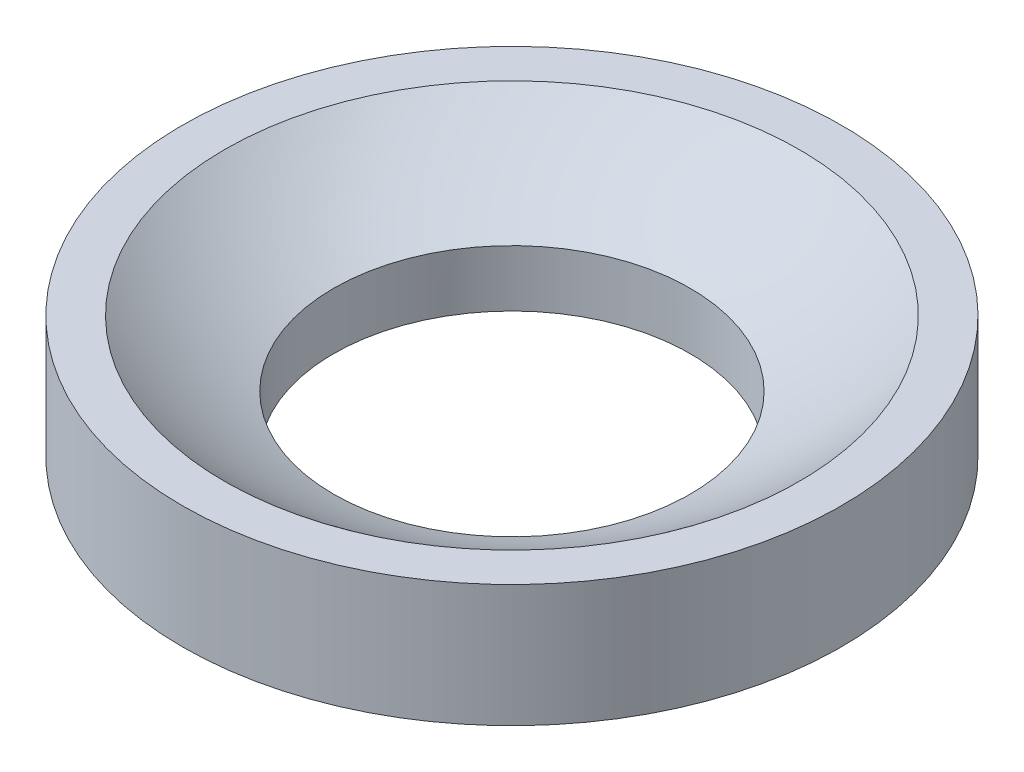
ISO-10303-21;
HEADER;
FILE_DESCRIPTION(('STEP AP214'),'2;1');
FILE_NAME('part.step','',(''),(''),'','','');
FILE_SCHEMA(('AUTOMOTIVE_DESIGN { 1 0 10303 214 1 1 1 1 }'));
ENDSEC;
DATA;
#1=APPLICATION_CONTEXT('core data for automotive mechanical design processes');
#2=APPLICATION_PROTOCOL_DEFINITION('international standard','automotive_design',2000,#1);
#3=PRODUCT_CONTEXT('',#1,'mechanical');
#4=PRODUCT('Part','Part','',(#3));
#5=PRODUCT_RELATED_PRODUCT_CATEGORY('part','',(#4));
#6=PRODUCT_DEFINITION_FORMATION('','',#4);
#7=PRODUCT_DEFINITION_CONTEXT('part definition',#1,'design');
#8=PRODUCT_DEFINITION('design','',#6,#7);
#9=PRODUCT_DEFINITION_SHAPE('','',#8);
#10=(LENGTH_UNIT() NAMED_UNIT(*) SI_UNIT(.MILLI.,.METRE.));
#11=(NAMED_UNIT(*) PLANE_ANGLE_UNIT() SI_UNIT($,.RADIAN.));
#12=(NAMED_UNIT(*) SI_UNIT($,.STERADIAN.) SOLID_ANGLE_UNIT());
#13=UNCERTAINTY_MEASURE_WITH_UNIT(LENGTH_MEASURE(1.E-05),#10,'distance_accuracy_value','');
#14=(GEOMETRIC_REPRESENTATION_CONTEXT(3) GLOBAL_UNCERTAINTY_ASSIGNED_CONTEXT((#13)) GLOBAL_UNIT_ASSIGNED_CONTEXT((#10,
#11,#12)) REPRESENTATION_CONTEXT('',''));
#15=CARTESIAN_POINT('',(0.,0.,0.));
#16=DIRECTION('',(0.,0.,1.));
#17=DIRECTION('',(1.,0.,0.));
#18=AXIS2_PLACEMENT_3D('',#15,#16,#17);
#19=CARTESIAN_POINT('',(474.940237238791,278.214667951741,0.));
#20=DIRECTION('',(0.,1.,0.));
#21=DIRECTION('',(-1.,0.,0.));
#22=AXIS2_PLACEMENT_3D('',#19,#20,#21);
#23=SPHERICAL_SURFACE('',#22,16.2707005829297);
#24=CARTESIAN_POINT('',(474.940237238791,265.57848191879,0.));
#25=DIRECTION('',(0.,1.,0.));
#26=DIRECTION('',(0.,0.,1.));
#27=AXIS2_PLACEMENT_3D('',#24,#25,#26);
#28=CIRCLE('',#27,10.25);
#29=CARTESIAN_POINT('',(464.690237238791,265.57848191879,0.));
#30=VERTEX_POINT('',#29);
#31=EDGE_CURVE('E49',#30,#30,#28,.T.);
#32=CARTESIAN_POINT('',(474.940237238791,263.23848360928,0.));
#33=DIRECTION('',(0.,1.,0.));
#34=DIRECTION('',(0.,0.,1.));
#35=AXIS2_PLACEMENT_3D('',#32,#33,#34);
#36=CIRCLE('',#35,6.35999999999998);
#37=CARTESIAN_POINT('',(468.580237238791,263.23848360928,0.));
#38=VERTEX_POINT('',#37);
#39=EDGE_CURVE('E10',#38,#38,#36,.T.);
#40=CARTESIAN_POINT('',(464.690237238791,265.57848191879,0.));
#41=CARTESIAN_POINT('',(464.727081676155,265.548595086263,0.));
#42=CARTESIAN_POINT('',(464.764056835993,265.518869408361,0.));
#43=CARTESIAN_POINT('',(464.838265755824,265.459742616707,0.));
#44=CARTESIAN_POINT('',(464.875499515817,265.430341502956,0.));
#45=CARTESIAN_POINT('',(464.950222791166,265.371866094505,0.));
#46=CARTESIAN_POINT('',(464.987712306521,265.342791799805,0.));
#47=CARTESIAN_POINT('',(465.06294422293,265.284972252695,0.));
#48=CARTESIAN_POINT('',(465.100686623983,265.256227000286,0.));
#49=CARTESIAN_POINT('',(465.176421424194,265.199067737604,0.));
#50=CARTESIAN_POINT('',(465.214413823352,265.170653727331,0.));
#51=CARTESIAN_POINT('',(465.290645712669,265.114159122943,0.));
#52=CARTESIAN_POINT('',(465.328885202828,265.086078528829,0.));
#53=CARTESIAN_POINT('',(465.405608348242,265.030252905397,0.));
#54=CARTESIAN_POINT('',(465.444092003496,265.00250787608,0.));
#55=CARTESIAN_POINT('',(465.521300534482,264.947355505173,0.));
#56=CARTESIAN_POINT('',(465.560025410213,264.919948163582,0.));
#57=CARTESIAN_POINT('',(465.637713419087,264.865473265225,0.));
#58=CARTESIAN_POINT('',(465.676676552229,264.838405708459,0.));
#59=CARTESIAN_POINT('',(465.754838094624,264.78461245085,0.));
#60=CARTESIAN_POINT('',(465.794036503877,264.757886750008,0.));
#61=CARTESIAN_POINT('',(465.872665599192,264.704779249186,0.));
#62=CARTESIAN_POINT('',(465.912096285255,264.678397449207,0.));
#63=CARTESIAN_POINT('',(465.991186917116,264.625979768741,0.));
#64=CARTESIAN_POINT('',(466.030846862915,264.599943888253,0.));
#65=CARTESIAN_POINT('',(466.110392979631,264.548220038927,0.));
#66=CARTESIAN_POINT('',(466.150279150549,264.522532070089,0.));
#67=CARTESIAN_POINT('',(466.230274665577,264.471506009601,0.));
#68=CARTESIAN_POINT('',(466.270384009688,264.44616791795,0.));
#69=CARTESIAN_POINT('',(466.350822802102,264.395843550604,0.));
#70=CARTESIAN_POINT('',(466.391152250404,264.370857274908,0.));
#71=CARTESIAN_POINT('',(466.472028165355,264.321238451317,0.));
#72=CARTESIAN_POINT('',(466.512574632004,264.296605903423,0.));
#73=CARTESIAN_POINT('',(466.5938814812,264.247696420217,0.));
#74=CARTESIAN_POINT('',(466.634641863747,264.223419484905,0.));
#75=CARTESIAN_POINT('',(466.716373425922,264.175223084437,0.));
#76=CARTESIAN_POINT('',(466.75734460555,264.15130361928,0.));
#77=CARTESIAN_POINT('',(466.839494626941,264.10382398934,0.));
#78=CARTESIAN_POINT('',(466.880673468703,264.080263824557,0.));
#79=CARTESIAN_POINT('',(466.963235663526,264.033504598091,0.));
#80=CARTESIAN_POINT('',(467.004619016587,264.010305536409,0.));
#81=CARTESIAN_POINT('',(467.087587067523,263.964270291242,0.));
#82=CARTESIAN_POINT('',(467.129171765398,263.941434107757,0.));
#83=CARTESIAN_POINT('',(467.212539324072,263.896126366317,0.));
#84=CARTESIAN_POINT('',(467.254322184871,263.873654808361,0.));
#85=CARTESIAN_POINT('',(467.33808287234,263.829078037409,0.));
#86=CARTESIAN_POINT('',(467.38006069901,263.806972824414,0.));
#87=CARTESIAN_POINT('',(467.464208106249,263.763130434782,0.));
#88=CARTESIAN_POINT('',(467.506377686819,263.741393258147,0.));
#89=CARTESIAN_POINT('',(467.590905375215,263.698288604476,0.));
#90=CARTESIAN_POINT('',(467.633263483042,263.676921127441,0.));
#91=CARTESIAN_POINT('',(467.718164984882,263.63455750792,0.));
#92=CARTESIAN_POINT('',(467.760708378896,263.613561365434,0.));
#93=CARTESIAN_POINT('',(467.84597719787,263.57194202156,0.));
#94=CARTESIAN_POINT('',(467.888702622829,263.551318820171,0.));
#95=CARTESIAN_POINT('',(467.974332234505,263.510446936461,0.));
#96=CARTESIAN_POINT('',(468.017236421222,263.49019825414,0.));
#97=CARTESIAN_POINT('',(468.103220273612,263.45007695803,0.));
#98=CARTESIAN_POINT('',(468.146299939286,263.430204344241,0.));
#99=CARTESIAN_POINT('',(468.232631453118,263.390836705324,0.));
#100=CARTESIAN_POINT('',(468.275883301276,263.371341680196,0.));
#101=CARTESIAN_POINT('',(468.362555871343,263.33273071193,0.));
#102=CARTESIAN_POINT('',(468.40597659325,263.313614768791,0.));
#103=CARTESIAN_POINT('',(468.492983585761,263.275763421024,0.));
#104=CARTESIAN_POINT('',(468.536569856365,263.257028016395,0.));
#105=CARTESIAN_POINT('',(468.580237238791,263.23848360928,0.));
#106=B_SPLINE_CURVE_WITH_KNOTS('',3,(#40,#41,#42,#43,#44,#45,#46,#47,#48,#49,#50,#51,#52,#53,
#54,#55,#56,#57,#58,#59,#60,#61,#62,#63,#64,#65,#66,#67,#68,#69,#70,#71,#72,#73,#74,#75,#76,#77,
#78,#79,#80,#81,#82,#83,#84,#85,#86,#87,#88,#89,#90,#91,#92,#93,#94,#95,#96,#97,#98,#99,#100,
#101,#102,#103,#104,#105),.UNSPECIFIED.,.F.,.F.,(4,2,2,2,2,2,2,2,2,2,2,2,2,2,2,2,2,2,2,2,2,2,2,
2,2,2,2,2,2,2,2,2,4),(0.,0.142325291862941,0.284650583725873,0.426975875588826,
0.569301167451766,0.711626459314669,0.853951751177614,0.996277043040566,1.1386023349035,
1.28092762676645,1.42325291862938,1.5655782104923,1.70790350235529,1.8502287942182,
1.99255408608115,2.13487937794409,2.27720466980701,2.41952996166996,2.56185525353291,
2.70418054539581,2.84650583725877,2.98883112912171,3.13115642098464,3.2734817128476,
3.41580700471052,3.55813229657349,3.7004575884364,3.84278288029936,3.98510817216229,
4.12743346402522,4.26975875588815,4.41208404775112,4.55440933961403),.UNSPECIFIED.);
#107=EDGE_CURVE('BSEAM30',#30,#38,#106,.T.);
#108=ORIENTED_EDGE('',*,*,#31,.T.);
#109=ORIENTED_EDGE('',*,*,#39,.F.);
#110=ORIENTED_EDGE('',*,*,#107,.T.);
#111=ORIENTED_EDGE('',*,*,#107,.F.);
#112=EDGE_LOOP('',(#108,#110,#109,#111));
#113=FACE_BOUND('',#112,.T.);
#114=ADVANCED_FACE('F30',(#113),#23,.F.);
#115=CARTESIAN_POINT('',(474.940237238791,265.57848191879,0.));
#116=DIRECTION('',(0.,1.,0.));
#117=DIRECTION('',(0.,0.,1.));
#118=AXIS2_PLACEMENT_3D('',#115,#116,#117);
#119=CYLINDRICAL_SURFACE('',#118,6.35999999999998);
#120=ORIENTED_EDGE('',*,*,#39,.T.);
#121=EDGE_LOOP('',(#120));
#122=FACE_BOUND('',#121,.T.);
#123=CARTESIAN_POINT('',(474.940237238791,261.21848191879,0.));
#124=DIRECTION('',(0.,1.,0.));
#125=DIRECTION('',(0.,0.,1.));
#126=AXIS2_PLACEMENT_3D('',#123,#124,#125);
#127=CIRCLE('',#126,6.35999999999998);
#128=CARTESIAN_POINT('',(474.940237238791,261.21848191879,6.35999999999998));
#129=VERTEX_POINT('',#128);
#130=EDGE_CURVE('E36',#129,#129,#127,.T.);
#131=ORIENTED_EDGE('',*,*,#130,.F.);
#132=EDGE_LOOP('',(#131));
#133=FACE_BOUND('',#132,.T.);
#134=ADVANCED_FACE('F67',(#122,#133),#119,.F.);
#135=CARTESIAN_POINT('',(463.18621194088,261.21848191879,0.));
#136=DIRECTION('',(0.,-1.,0.));
#137=DIRECTION('',(0.,0.,-1.));
#138=AXIS2_PLACEMENT_3D('',#135,#136,#137);
#139=PLANE('',#138);
#140=ORIENTED_EDGE('',*,*,#130,.T.);
#141=EDGE_LOOP('',(#140));
#142=FACE_BOUND('',#141,.T.);
#143=CARTESIAN_POINT('',(474.940237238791,261.21848191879,0.));
#144=DIRECTION('',(0.,1.,0.));
#145=DIRECTION('',(0.,0.,1.));
#146=AXIS2_PLACEMENT_3D('',#143,#144,#145);
#147=CIRCLE('',#146,11.7540252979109);
#148=CARTESIAN_POINT('',(474.940237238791,261.21848191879,11.7540252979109));
#149=VERTEX_POINT('',#148);
#150=EDGE_CURVE('E40',#149,#149,#147,.T.);
#151=ORIENTED_EDGE('',*,*,#150,.F.);
#152=EDGE_LOOP('',(#151));
#153=FACE_BOUND('',#152,.T.);
#154=ADVANCED_FACE('F63',(#142,#153),#139,.T.);
#155=CARTESIAN_POINT('',(474.940237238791,265.57848191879,0.));
#156=DIRECTION('',(0.,1.,0.));
#157=DIRECTION('',(0.,0.,1.));
#158=AXIS2_PLACEMENT_3D('',#155,#156,#157);
#159=CYLINDRICAL_SURFACE('',#158,11.7540252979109);
#160=ORIENTED_EDGE('',*,*,#150,.T.);
#161=EDGE_LOOP('',(#160));
#162=FACE_BOUND('',#161,.T.);
#163=CARTESIAN_POINT('',(474.940237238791,265.57848191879,0.));
#164=DIRECTION('',(0.,1.,0.));
#165=DIRECTION('',(0.,0.,1.));
#166=AXIS2_PLACEMENT_3D('',#163,#164,#165);
#167=CIRCLE('',#166,11.7540252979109);
#168=CARTESIAN_POINT('',(474.940237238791,265.57848191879,11.7540252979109));
#169=VERTEX_POINT('',#168);
#170=EDGE_CURVE('E44',#169,#169,#167,.T.);
#171=ORIENTED_EDGE('',*,*,#170,.F.);
#172=EDGE_LOOP('',(#171));
#173=FACE_BOUND('',#172,.T.);
#174=ADVANCED_FACE('F57',(#162,#173),#159,.T.);
#175=CARTESIAN_POINT('',(463.18621194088,265.57848191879,0.));
#176=DIRECTION('',(0.,1.,0.));
#177=DIRECTION('',(0.,0.,1.));
#178=AXIS2_PLACEMENT_3D('',#175,#176,#177);
#179=PLANE('',#178);
#180=ORIENTED_EDGE('',*,*,#170,.T.);
#181=EDGE_LOOP('',(#180));
#182=FACE_BOUND('',#181,.T.);
#183=ORIENTED_EDGE('',*,*,#31,.F.);
#184=EDGE_LOOP('',(#183));
#185=FACE_BOUND('',#184,.T.);
#186=ADVANCED_FACE('F55',(#182,#185),#179,.T.);
#187=CLOSED_SHELL('',(#114,#134,#154,#174,#186));
#188=MANIFOLD_SOLID_BREP('B2',#187);
#189=ADVANCED_BREP_SHAPE_REPRESENTATION('',(#18,#188),#14);
#190=SHAPE_DEFINITION_REPRESENTATION(#9,#189);
ENDSEC;
END-ISO-10303-21;
